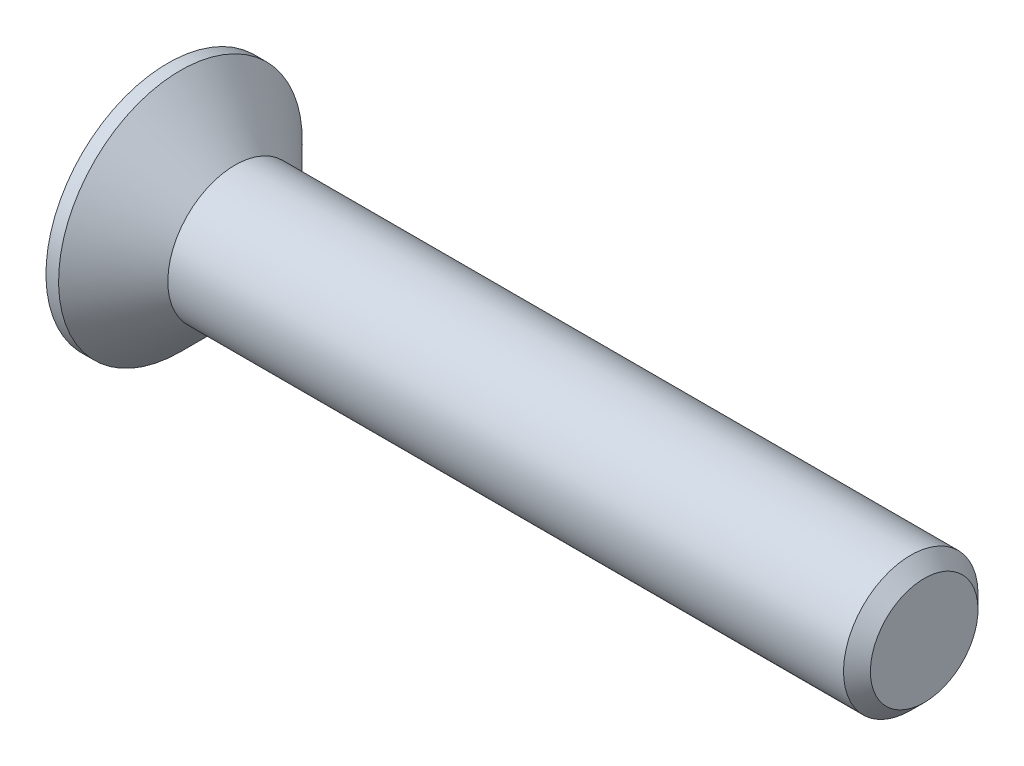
ISO-10303-21;
HEADER;
FILE_DESCRIPTION(('STEP AP214'),'2;1');
FILE_NAME('part.step','',(''),(''),'','','');
FILE_SCHEMA(('AUTOMOTIVE_DESIGN { 1 0 10303 214 1 1 1 1 }'));
ENDSEC;
DATA;
#1=APPLICATION_CONTEXT('core data for automotive mechanical design processes');
#2=APPLICATION_PROTOCOL_DEFINITION('international standard','automotive_design',2000,#1);
#3=PRODUCT_CONTEXT('',#1,'mechanical');
#4=PRODUCT('Part','Part','',(#3));
#5=PRODUCT_RELATED_PRODUCT_CATEGORY('part','',(#4));
#6=PRODUCT_DEFINITION_FORMATION('','',#4);
#7=PRODUCT_DEFINITION_CONTEXT('part definition',#1,'design');
#8=PRODUCT_DEFINITION('design','',#6,#7);
#9=PRODUCT_DEFINITION_SHAPE('','',#8);
#10=(LENGTH_UNIT() NAMED_UNIT(*) SI_UNIT(.MILLI.,.METRE.));
#11=(NAMED_UNIT(*) PLANE_ANGLE_UNIT() SI_UNIT($,.RADIAN.));
#12=(NAMED_UNIT(*) SI_UNIT($,.STERADIAN.) SOLID_ANGLE_UNIT());
#13=UNCERTAINTY_MEASURE_WITH_UNIT(LENGTH_MEASURE(1.E-05),#10,'distance_accuracy_value','');
#14=(GEOMETRIC_REPRESENTATION_CONTEXT(3) GLOBAL_UNCERTAINTY_ASSIGNED_CONTEXT((#13)) GLOBAL_UNIT_ASSIGNED_CONTEXT((#10,
#11,#12)) REPRESENTATION_CONTEXT('',''));
#15=CARTESIAN_POINT('',(0.,0.,0.));
#16=DIRECTION('',(0.,0.,1.));
#17=DIRECTION('',(1.,0.,0.));
#18=AXIS2_PLACEMENT_3D('',#15,#16,#17);
#19=CARTESIAN_POINT('',(0.,0.,0.));
#20=DIRECTION('',(-1.,0.,0.));
#21=DIRECTION('',(0.,-1.,0.));
#22=AXIS2_PLACEMENT_3D('',#19,#20,#21);
#23=CONICAL_SURFACE('',#22,4.,0.78539816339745);
#24=CARTESIAN_POINT('',(-3.24999999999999,0.,0.));
#25=DIRECTION('',(-1.,0.,0.));
#26=DIRECTION('',(0.,-1.,0.));
#27=AXIS2_PLACEMENT_3D('',#24,#25,#26);
#28=CIRCLE('',#27,7.25);
#29=CARTESIAN_POINT('',(-3.24999999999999,-7.25,0.));
#30=VERTEX_POINT('',#29);
#31=EDGE_CURVE('E189',#30,#30,#28,.T.);
#32=ORIENTED_EDGE('',*,*,#31,.F.);
#33=EDGE_LOOP('',(#32));
#34=FACE_BOUND('',#33,.T.);
#35=CARTESIAN_POINT('',(0.,0.,0.));
#36=DIRECTION('',(-1.,0.,0.));
#37=DIRECTION('',(0.,-1.,0.));
#38=AXIS2_PLACEMENT_3D('',#35,#36,#37);
#39=CIRCLE('',#38,4.);
#40=CARTESIAN_POINT('',(0.,-4.,0.));
#41=VERTEX_POINT('',#40);
#42=EDGE_CURVE('E212',#41,#41,#39,.T.);
#43=ORIENTED_EDGE('',*,*,#42,.T.);
#44=EDGE_LOOP('',(#43));
#45=FACE_BOUND('',#44,.T.);
#46=ADVANCED_FACE('F33',(#34,#45),#23,.T.);
#47=CARTESIAN_POINT('',(-4.,0.,0.));
#48=DIRECTION('',(-1.,0.,0.));
#49=DIRECTION('',(0.,-1.,0.));
#50=AXIS2_PLACEMENT_3D('',#47,#48,#49);
#51=CYLINDRICAL_SURFACE('',#50,4.);
#52=CARTESIAN_POINT('',(40.2,0.,0.));
#53=DIRECTION('',(-1.,0.,0.));
#54=DIRECTION('',(0.,-1.,0.));
#55=AXIS2_PLACEMENT_3D('',#52,#53,#54);
#56=CIRCLE('',#55,4.);
#57=CARTESIAN_POINT('',(40.2,-4.,0.));
#58=VERTEX_POINT('',#57);
#59=EDGE_CURVE('E41',#58,#58,#56,.T.);
#60=ORIENTED_EDGE('',*,*,#59,.T.);
#61=EDGE_LOOP('',(#60));
#62=FACE_BOUND('',#61,.T.);
#63=ORIENTED_EDGE('',*,*,#42,.F.);
#64=EDGE_LOOP('',(#63));
#65=FACE_BOUND('',#64,.T.);
#66=ADVANCED_FACE('F217',(#62,#65),#51,.T.);
#67=CARTESIAN_POINT('',(41.,0.,0.));
#68=DIRECTION('',(-1.,0.,0.));
#69=DIRECTION('',(0.,-1.,0.));
#70=AXIS2_PLACEMENT_3D('',#67,#68,#69);
#71=PLANE('',#70);
#72=CARTESIAN_POINT('',(41.,0.,0.));
#73=DIRECTION('',(-1.,0.,0.));
#74=DIRECTION('',(0.,-1.,0.));
#75=AXIS2_PLACEMENT_3D('',#72,#73,#74);
#76=CIRCLE('',#75,3.19999999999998);
#77=CARTESIAN_POINT('',(41.,-3.19999999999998,0.));
#78=VERTEX_POINT('',#77);
#79=EDGE_CURVE('E11',#78,#78,#76,.F.);
#80=ORIENTED_EDGE('',*,*,#79,.T.);
#81=EDGE_LOOP('',(#80));
#82=FACE_BOUND('',#81,.T.);
#83=ADVANCED_FACE('F239',(#82),#71,.F.);
#84=CARTESIAN_POINT('',(-4.,7.25,0.));
#85=DIRECTION('',(1.,0.,0.));
#86=DIRECTION('',(0.,1.,0.));
#87=AXIS2_PLACEMENT_3D('',#84,#85,#86);
#88=PLANE('',#87);
#89=DIRECTION('',(0.,0.,-1.));
#90=VECTOR('',#89,1.);
#91=CARTESIAN_POINT('',(-4.,1.09,-4.35));
#92=LINE('',#91,#90);
#93=CARTESIAN_POINT('',(-4.,1.09,-1.09));
#94=VERTEX_POINT('',#93);
#95=CARTESIAN_POINT('',(-4.,1.09,-4.35));
#96=VERTEX_POINT('',#95);
#97=EDGE_CURVE('E158',#94,#96,#92,.T.);
#98=ORIENTED_EDGE('',*,*,#97,.F.);
#99=DIRECTION('',(0.,-1.,0.));
#100=VECTOR('',#99,1.);
#101=CARTESIAN_POINT('',(-4.,1.09,-1.09));
#102=LINE('',#101,#100);
#103=CARTESIAN_POINT('',(-4.,4.35,-1.09));
#104=VERTEX_POINT('',#103);
#105=EDGE_CURVE('E48',#104,#94,#102,.T.);
#106=ORIENTED_EDGE('',*,*,#105,.F.);
#107=DIRECTION('',(0.,0.,-1.));
#108=VECTOR('',#107,1.);
#109=CARTESIAN_POINT('',(-4.,4.35,-1.09));
#110=LINE('',#109,#108);
#111=CARTESIAN_POINT('',(-4.,4.35,1.09));
#112=VERTEX_POINT('',#111);
#113=EDGE_CURVE('E185',#112,#104,#110,.T.);
#114=ORIENTED_EDGE('',*,*,#113,.F.);
#115=DIRECTION('',(0.,1.,0.));
#116=VECTOR('',#115,1.);
#117=CARTESIAN_POINT('',(-4.,4.35,1.09));
#118=LINE('',#117,#116);
#119=CARTESIAN_POINT('',(-4.,1.09,1.09));
#120=VERTEX_POINT('',#119);
#121=EDGE_CURVE('E183',#120,#112,#118,.T.);
#122=ORIENTED_EDGE('',*,*,#121,.F.);
#123=DIRECTION('',(0.,0.,-1.));
#124=VECTOR('',#123,1.);
#125=CARTESIAN_POINT('',(-4.,1.09,1.09));
#126=LINE('',#125,#124);
#127=CARTESIAN_POINT('',(-4.,1.09,4.35));
#128=VERTEX_POINT('',#127);
#129=EDGE_CURVE('E132',#128,#120,#126,.T.);
#130=ORIENTED_EDGE('',*,*,#129,.F.);
#131=DIRECTION('',(0.,1.,0.));
#132=VECTOR('',#131,1.);
#133=CARTESIAN_POINT('',(-4.,1.09,4.35));
#134=LINE('',#133,#132);
#135=CARTESIAN_POINT('',(-4.,-1.09,4.35));
#136=VERTEX_POINT('',#135);
#137=EDGE_CURVE('E179',#136,#128,#134,.T.);
#138=ORIENTED_EDGE('',*,*,#137,.F.);
#139=DIRECTION('',(0.,0.,1.));
#140=VECTOR('',#139,1.);
#141=CARTESIAN_POINT('',(-4.,-1.09,4.35));
#142=LINE('',#141,#140);
#143=CARTESIAN_POINT('',(-4.,-1.09,1.09));
#144=VERTEX_POINT('',#143);
#145=EDGE_CURVE('E176',#144,#136,#142,.T.);
#146=ORIENTED_EDGE('',*,*,#145,.F.);
#147=DIRECTION('',(0.,1.,0.));
#148=VECTOR('',#147,1.);
#149=CARTESIAN_POINT('',(-4.,-1.09,1.09));
#150=LINE('',#149,#148);
#151=CARTESIAN_POINT('',(-4.,-4.35,1.09));
#152=VERTEX_POINT('',#151);
#153=EDGE_CURVE('E173',#152,#144,#150,.T.);
#154=ORIENTED_EDGE('',*,*,#153,.F.);
#155=DIRECTION('',(0.,0.,1.));
#156=VECTOR('',#155,1.);
#157=CARTESIAN_POINT('',(-4.,-4.35,1.09));
#158=LINE('',#157,#156);
#159=CARTESIAN_POINT('',(-4.,-4.35,-1.09));
#160=VERTEX_POINT('',#159);
#161=EDGE_CURVE('E170',#160,#152,#158,.T.);
#162=ORIENTED_EDGE('',*,*,#161,.F.);
#163=DIRECTION('',(0.,-1.,0.));
#164=VECTOR('',#163,1.);
#165=CARTESIAN_POINT('',(-4.,-4.35,-1.09));
#166=LINE('',#165,#164);
#167=CARTESIAN_POINT('',(-4.,-1.09,-1.09));
#168=VERTEX_POINT('',#167);
#169=EDGE_CURVE('E167',#168,#160,#166,.T.);
#170=ORIENTED_EDGE('',*,*,#169,.F.);
#171=DIRECTION('',(0.,0.,1.));
#172=VECTOR('',#171,1.);
#173=CARTESIAN_POINT('',(-4.,-1.09,-1.09));
#174=LINE('',#173,#172);
#175=CARTESIAN_POINT('',(-4.,-1.09,-4.35));
#176=VERTEX_POINT('',#175);
#177=EDGE_CURVE('E164',#176,#168,#174,.T.);
#178=ORIENTED_EDGE('',*,*,#177,.F.);
#179=DIRECTION('',(0.,-1.,0.));
#180=VECTOR('',#179,1.);
#181=CARTESIAN_POINT('',(-4.,-1.09,-4.35));
#182=LINE('',#181,#180);
#183=EDGE_CURVE('E161',#96,#176,#182,.T.);
#184=ORIENTED_EDGE('',*,*,#183,.F.);
#185=EDGE_LOOP('',(#98,#106,#114,#122,#130,#138,#146,#154,#162,#170,#178,#184));
#186=FACE_BOUND('',#185,.T.);
#187=CARTESIAN_POINT('',(-4.,0.,0.));
#188=DIRECTION('',(-1.,0.,0.));
#189=DIRECTION('',(0.,-1.,0.));
#190=AXIS2_PLACEMENT_3D('',#187,#188,#189);
#191=CIRCLE('',#190,7.25);
#192=CARTESIAN_POINT('',(-4.,-7.25,0.));
#193=VERTEX_POINT('',#192);
#194=EDGE_CURVE('E209',#193,#193,#191,.T.);
#195=ORIENTED_EDGE('',*,*,#194,.T.);
#196=EDGE_LOOP('',(#195));
#197=FACE_BOUND('',#196,.T.);
#198=ADVANCED_FACE('F230',(#186,#197),#88,.F.);
#199=CARTESIAN_POINT('',(-4.,0.,0.));
#200=DIRECTION('',(-1.,0.,0.));
#201=DIRECTION('',(0.,-1.,0.));
#202=AXIS2_PLACEMENT_3D('',#199,#200,#201);
#203=CYLINDRICAL_SURFACE('',#202,7.25);
#204=ORIENTED_EDGE('',*,*,#194,.F.);
#205=EDGE_LOOP('',(#204));
#206=FACE_BOUND('',#205,.T.);
#207=ORIENTED_EDGE('',*,*,#31,.T.);
#208=EDGE_LOOP('',(#207));
#209=FACE_BOUND('',#208,.T.);
#210=ADVANCED_FACE('F222',(#206,#209),#203,.T.);
#211=CARTESIAN_POINT('',(40.2,0.,0.));
#212=DIRECTION('',(-1.,0.,0.));
#213=DIRECTION('',(0.,-1.,0.));
#214=AXIS2_PLACEMENT_3D('',#211,#212,#213);
#215=CONICAL_SURFACE('',#214,4.,0.785398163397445);
#216=ORIENTED_EDGE('',*,*,#79,.F.);
#217=EDGE_LOOP('',(#216));
#218=FACE_BOUND('',#217,.T.);
#219=ORIENTED_EDGE('',*,*,#59,.F.);
#220=EDGE_LOOP('',(#219));
#221=FACE_BOUND('',#220,.T.);
#222=ADVANCED_FACE('F35',(#218,#221),#215,.T.);
#223=CARTESIAN_POINT('',(-0.55,1.09,-1.09));
#224=DIRECTION('',(0.,0.,-1.));
#225=DIRECTION('',(-1.,0.,0.));
#226=AXIS2_PLACEMENT_3D('',#223,#224,#225);
#227=PLANE('',#226);
#228=ORIENTED_EDGE('',*,*,#105,.T.);
#229=DIRECTION('',(-1.,0.,0.));
#230=VECTOR('',#229,1.);
#231=CARTESIAN_POINT('',(-0.55,1.09,-1.09));
#232=LINE('',#231,#230);
#233=CARTESIAN_POINT('',(-0.55,1.09,-1.09));
#234=VERTEX_POINT('',#233);
#235=EDGE_CURVE('E96',#234,#94,#232,.T.);
#236=ORIENTED_EDGE('',*,*,#235,.F.);
#237=DIRECTION('',(0.,-1.,0.));
#238=VECTOR('',#237,1.);
#239=CARTESIAN_POINT('',(-0.55,1.09,-1.09));
#240=LINE('',#239,#238);
#241=CARTESIAN_POINT('',(-0.55,4.35,-1.09));
#242=VERTEX_POINT('',#241);
#243=EDGE_CURVE('E187',#242,#234,#240,.T.);
#244=ORIENTED_EDGE('',*,*,#243,.F.);
#245=DIRECTION('',(-1.,0.,0.));
#246=VECTOR('',#245,1.);
#247=CARTESIAN_POINT('',(-0.55,4.35,-1.09));
#248=LINE('',#247,#246);
#249=EDGE_CURVE('E56',#242,#104,#248,.T.);
#250=ORIENTED_EDGE('',*,*,#249,.T.);
#251=EDGE_LOOP('',(#228,#236,#244,#250));
#252=FACE_BOUND('',#251,.T.);
#253=ADVANCED_FACE('F221',(#252),#227,.F.);
#254=CARTESIAN_POINT('',(-0.55,4.35,-1.09));
#255=DIRECTION('',(0.,1.,0.));
#256=DIRECTION('',(-1.,0.,0.));
#257=AXIS2_PLACEMENT_3D('',#254,#255,#256);
#258=PLANE('',#257);
#259=ORIENTED_EDGE('',*,*,#113,.T.);
#260=ORIENTED_EDGE('',*,*,#249,.F.);
#261=DIRECTION('',(0.,0.,-1.));
#262=VECTOR('',#261,1.);
#263=CARTESIAN_POINT('',(-0.55,4.35,-1.09));
#264=LINE('',#263,#262);
#265=CARTESIAN_POINT('',(-0.55,4.35,1.09));
#266=VERTEX_POINT('',#265);
#267=EDGE_CURVE('E144',#266,#242,#264,.T.);
#268=ORIENTED_EDGE('',*,*,#267,.F.);
#269=DIRECTION('',(-1.,0.,0.));
#270=VECTOR('',#269,1.);
#271=CARTESIAN_POINT('',(-0.55,4.35,1.09));
#272=LINE('',#271,#270);
#273=EDGE_CURVE('E136',#266,#112,#272,.T.);
#274=ORIENTED_EDGE('',*,*,#273,.T.);
#275=EDGE_LOOP('',(#259,#260,#268,#274));
#276=FACE_BOUND('',#275,.T.);
#277=ADVANCED_FACE('F228',(#276),#258,.F.);
#278=CARTESIAN_POINT('',(-0.55,4.35,1.09));
#279=DIRECTION('',(0.,0.,1.));
#280=DIRECTION('',(1.,0.,0.));
#281=AXIS2_PLACEMENT_3D('',#278,#279,#280);
#282=PLANE('',#281);
#283=ORIENTED_EDGE('',*,*,#121,.T.);
#284=ORIENTED_EDGE('',*,*,#273,.F.);
#285=DIRECTION('',(0.,1.,0.));
#286=VECTOR('',#285,1.);
#287=CARTESIAN_POINT('',(-0.55,4.35,1.09));
#288=LINE('',#287,#286);
#289=CARTESIAN_POINT('',(-0.55,1.09,1.09));
#290=VERTEX_POINT('',#289);
#291=EDGE_CURVE('E140',#290,#266,#288,.T.);
#292=ORIENTED_EDGE('',*,*,#291,.F.);
#293=DIRECTION('',(-1.,0.,0.));
#294=VECTOR('',#293,1.);
#295=CARTESIAN_POINT('',(-0.55,1.09,1.09));
#296=LINE('',#295,#294);
#297=EDGE_CURVE('E125',#290,#120,#296,.T.);
#298=ORIENTED_EDGE('',*,*,#297,.T.);
#299=EDGE_LOOP('',(#283,#284,#292,#298));
#300=FACE_BOUND('',#299,.T.);
#301=ADVANCED_FACE('F141',(#300),#282,.F.);
#302=CARTESIAN_POINT('',(-0.55,1.09,1.09));
#303=DIRECTION('',(0.,1.,0.));
#304=DIRECTION('',(-1.,0.,0.));
#305=AXIS2_PLACEMENT_3D('',#302,#303,#304);
#306=PLANE('',#305);
#307=ORIENTED_EDGE('',*,*,#129,.T.);
#308=ORIENTED_EDGE('',*,*,#297,.F.);
#309=DIRECTION('',(0.,0.,-1.));
#310=VECTOR('',#309,1.);
#311=CARTESIAN_POINT('',(-0.55,1.09,1.09));
#312=LINE('',#311,#310);
#313=CARTESIAN_POINT('',(-0.55,1.09,4.35));
#314=VERTEX_POINT('',#313);
#315=EDGE_CURVE('E129',#314,#290,#312,.T.);
#316=ORIENTED_EDGE('',*,*,#315,.F.);
#317=DIRECTION('',(-1.,0.,0.));
#318=VECTOR('',#317,1.);
#319=CARTESIAN_POINT('',(-0.55,1.09,4.35));
#320=LINE('',#319,#318);
#321=EDGE_CURVE('E137',#314,#128,#320,.T.);
#322=ORIENTED_EDGE('',*,*,#321,.T.);
#323=EDGE_LOOP('',(#307,#308,#316,#322));
#324=FACE_BOUND('',#323,.T.);
#325=ADVANCED_FACE('F127',(#324),#306,.F.);
#326=CARTESIAN_POINT('',(-0.55,1.09,4.35));
#327=DIRECTION('',(0.,0.,1.));
#328=DIRECTION('',(1.,0.,0.));
#329=AXIS2_PLACEMENT_3D('',#326,#327,#328);
#330=PLANE('',#329);
#331=ORIENTED_EDGE('',*,*,#137,.T.);
#332=ORIENTED_EDGE('',*,*,#321,.F.);
#333=DIRECTION('',(0.,1.,0.));
#334=VECTOR('',#333,1.);
#335=CARTESIAN_POINT('',(-0.55,1.09,4.35));
#336=LINE('',#335,#334);
#337=CARTESIAN_POINT('',(-0.55,-1.09,4.35));
#338=VERTEX_POINT('',#337);
#339=EDGE_CURVE('E150',#338,#314,#336,.T.);
#340=ORIENTED_EDGE('',*,*,#339,.F.);
#341=DIRECTION('',(-1.,0.,0.));
#342=VECTOR('',#341,1.);
#343=CARTESIAN_POINT('',(-0.55,-1.09,4.35));
#344=LINE('',#343,#342);
#345=EDGE_CURVE('E192',#338,#136,#344,.T.);
#346=ORIENTED_EDGE('',*,*,#345,.T.);
#347=EDGE_LOOP('',(#331,#332,#340,#346));
#348=FACE_BOUND('',#347,.T.);
#349=ADVANCED_FACE('F277',(#348),#330,.F.);
#350=CARTESIAN_POINT('',(-0.55,-1.09,4.35));
#351=DIRECTION('',(0.,-1.,0.));
#352=DIRECTION('',(1.,0.,0.));
#353=AXIS2_PLACEMENT_3D('',#350,#351,#352);
#354=PLANE('',#353);
#355=ORIENTED_EDGE('',*,*,#145,.T.);
#356=ORIENTED_EDGE('',*,*,#345,.F.);
#357=DIRECTION('',(0.,0.,1.));
#358=VECTOR('',#357,1.);
#359=CARTESIAN_POINT('',(-0.55,-1.09,4.35));
#360=LINE('',#359,#358);
#361=CARTESIAN_POINT('',(-0.55,-1.09,1.09));
#362=VERTEX_POINT('',#361);
#363=EDGE_CURVE('E152',#362,#338,#360,.T.);
#364=ORIENTED_EDGE('',*,*,#363,.F.);
#365=DIRECTION('',(-1.,0.,0.));
#366=VECTOR('',#365,1.);
#367=CARTESIAN_POINT('',(-0.55,-1.09,1.09));
#368=LINE('',#367,#366);
#369=EDGE_CURVE('E194',#362,#144,#368,.T.);
#370=ORIENTED_EDGE('',*,*,#369,.T.);
#371=EDGE_LOOP('',(#355,#356,#364,#370));
#372=FACE_BOUND('',#371,.T.);
#373=ADVANCED_FACE('F273',(#372),#354,.F.);
#374=CARTESIAN_POINT('',(-0.55,-1.09,1.09));
#375=DIRECTION('',(0.,0.,1.));
#376=DIRECTION('',(1.,0.,0.));
#377=AXIS2_PLACEMENT_3D('',#374,#375,#376);
#378=PLANE('',#377);
#379=ORIENTED_EDGE('',*,*,#153,.T.);
#380=ORIENTED_EDGE('',*,*,#369,.F.);
#381=DIRECTION('',(0.,1.,0.));
#382=VECTOR('',#381,1.);
#383=CARTESIAN_POINT('',(-0.55,-1.09,1.09));
#384=LINE('',#383,#382);
#385=CARTESIAN_POINT('',(-0.55,-4.35,1.09));
#386=VERTEX_POINT('',#385);
#387=EDGE_CURVE('E422',#386,#362,#384,.T.);
#388=ORIENTED_EDGE('',*,*,#387,.F.);
#389=DIRECTION('',(-1.,0.,0.));
#390=VECTOR('',#389,1.);
#391=CARTESIAN_POINT('',(-0.55,-4.35,1.09));
#392=LINE('',#391,#390);
#393=EDGE_CURVE('E196',#386,#152,#392,.T.);
#394=ORIENTED_EDGE('',*,*,#393,.T.);
#395=EDGE_LOOP('',(#379,#380,#388,#394));
#396=FACE_BOUND('',#395,.T.);
#397=ADVANCED_FACE('F269',(#396),#378,.F.);
#398=CARTESIAN_POINT('',(-0.55,-4.35,1.09));
#399=DIRECTION('',(0.,-1.,0.));
#400=DIRECTION('',(1.,0.,0.));
#401=AXIS2_PLACEMENT_3D('',#398,#399,#400);
#402=PLANE('',#401);
#403=ORIENTED_EDGE('',*,*,#161,.T.);
#404=ORIENTED_EDGE('',*,*,#393,.F.);
#405=DIRECTION('',(0.,0.,1.));
#406=VECTOR('',#405,1.);
#407=CARTESIAN_POINT('',(-0.55,-4.35,1.09));
#408=LINE('',#407,#406);
#409=CARTESIAN_POINT('',(-0.55,-4.35,-1.09));
#410=VERTEX_POINT('',#409);
#411=EDGE_CURVE('E419',#410,#386,#408,.T.);
#412=ORIENTED_EDGE('',*,*,#411,.F.);
#413=DIRECTION('',(-1.,0.,0.));
#414=VECTOR('',#413,1.);
#415=CARTESIAN_POINT('',(-0.55,-4.35,-1.09));
#416=LINE('',#415,#414);
#417=EDGE_CURVE('E198',#410,#160,#416,.T.);
#418=ORIENTED_EDGE('',*,*,#417,.T.);
#419=EDGE_LOOP('',(#403,#404,#412,#418));
#420=FACE_BOUND('',#419,.T.);
#421=ADVANCED_FACE('F265',(#420),#402,.F.);
#422=CARTESIAN_POINT('',(-0.55,-4.35,-1.09));
#423=DIRECTION('',(0.,0.,-1.));
#424=DIRECTION('',(-1.,0.,0.));
#425=AXIS2_PLACEMENT_3D('',#422,#423,#424);
#426=PLANE('',#425);
#427=ORIENTED_EDGE('',*,*,#169,.T.);
#428=ORIENTED_EDGE('',*,*,#417,.F.);
#429=DIRECTION('',(0.,-1.,0.));
#430=VECTOR('',#429,1.);
#431=CARTESIAN_POINT('',(-0.55,-4.35,-1.09));
#432=LINE('',#431,#430);
#433=CARTESIAN_POINT('',(-0.55,-1.09,-1.09));
#434=VERTEX_POINT('',#433);
#435=EDGE_CURVE('E416',#434,#410,#432,.T.);
#436=ORIENTED_EDGE('',*,*,#435,.F.);
#437=DIRECTION('',(-1.,0.,0.));
#438=VECTOR('',#437,1.);
#439=CARTESIAN_POINT('',(-0.55,-1.09,-1.09));
#440=LINE('',#439,#438);
#441=EDGE_CURVE('E200',#434,#168,#440,.T.);
#442=ORIENTED_EDGE('',*,*,#441,.T.);
#443=EDGE_LOOP('',(#427,#428,#436,#442));
#444=FACE_BOUND('',#443,.T.);
#445=ADVANCED_FACE('F261',(#444),#426,.F.);
#446=CARTESIAN_POINT('',(-0.55,-1.09,-1.09));
#447=DIRECTION('',(0.,-1.,0.));
#448=DIRECTION('',(1.,0.,0.));
#449=AXIS2_PLACEMENT_3D('',#446,#447,#448);
#450=PLANE('',#449);
#451=ORIENTED_EDGE('',*,*,#177,.T.);
#452=ORIENTED_EDGE('',*,*,#441,.F.);
#453=DIRECTION('',(0.,0.,1.));
#454=VECTOR('',#453,1.);
#455=CARTESIAN_POINT('',(-0.55,-1.09,-1.09));
#456=LINE('',#455,#454);
#457=CARTESIAN_POINT('',(-0.55,-1.09,-4.35));
#458=VERTEX_POINT('',#457);
#459=EDGE_CURVE('E413',#458,#434,#456,.T.);
#460=ORIENTED_EDGE('',*,*,#459,.F.);
#461=DIRECTION('',(-1.,0.,0.));
#462=VECTOR('',#461,1.);
#463=CARTESIAN_POINT('',(-0.55,-1.09,-4.35));
#464=LINE('',#463,#462);
#465=EDGE_CURVE('E202',#458,#176,#464,.T.);
#466=ORIENTED_EDGE('',*,*,#465,.T.);
#467=EDGE_LOOP('',(#451,#452,#460,#466));
#468=FACE_BOUND('',#467,.T.);
#469=ADVANCED_FACE('F257',(#468),#450,.F.);
#470=CARTESIAN_POINT('',(-0.55,-1.09,-4.35));
#471=DIRECTION('',(0.,0.,-1.));
#472=DIRECTION('',(-1.,0.,0.));
#473=AXIS2_PLACEMENT_3D('',#470,#471,#472);
#474=PLANE('',#473);
#475=ORIENTED_EDGE('',*,*,#183,.T.);
#476=ORIENTED_EDGE('',*,*,#465,.F.);
#477=DIRECTION('',(0.,-1.,0.));
#478=VECTOR('',#477,1.);
#479=CARTESIAN_POINT('',(-0.55,-1.09,-4.35));
#480=LINE('',#479,#478);
#481=CARTESIAN_POINT('',(-0.55,1.09,-4.35));
#482=VERTEX_POINT('',#481);
#483=EDGE_CURVE('E408',#482,#458,#480,.T.);
#484=ORIENTED_EDGE('',*,*,#483,.F.);
#485=DIRECTION('',(-1.,0.,0.));
#486=VECTOR('',#485,1.);
#487=CARTESIAN_POINT('',(-0.55,1.09,-4.35));
#488=LINE('',#487,#486);
#489=EDGE_CURVE('E204',#482,#96,#488,.T.);
#490=ORIENTED_EDGE('',*,*,#489,.T.);
#491=EDGE_LOOP('',(#475,#476,#484,#490));
#492=FACE_BOUND('',#491,.T.);
#493=ADVANCED_FACE('F253',(#492),#474,.F.);
#494=CARTESIAN_POINT('',(-0.55,1.09,-4.35));
#495=DIRECTION('',(0.,1.,0.));
#496=DIRECTION('',(-1.,0.,0.));
#497=AXIS2_PLACEMENT_3D('',#494,#495,#496);
#498=PLANE('',#497);
#499=ORIENTED_EDGE('',*,*,#97,.T.);
#500=ORIENTED_EDGE('',*,*,#489,.F.);
#501=DIRECTION('',(0.,0.,-1.));
#502=VECTOR('',#501,1.);
#503=CARTESIAN_POINT('',(-0.55,1.09,-4.35));
#504=LINE('',#503,#502);
#505=EDGE_CURVE('E406',#234,#482,#504,.T.);
#506=ORIENTED_EDGE('',*,*,#505,.F.);
#507=ORIENTED_EDGE('',*,*,#235,.T.);
#508=EDGE_LOOP('',(#499,#500,#506,#507));
#509=FACE_BOUND('',#508,.T.);
#510=ADVANCED_FACE('F250',(#509),#498,.F.);
#511=CARTESIAN_POINT('',(-0.55,0.,0.));
#512=DIRECTION('',(1.,0.,0.));
#513=DIRECTION('',(0.,0.,-1.));
#514=AXIS2_PLACEMENT_3D('',#511,#512,#513);
#515=PLANE('',#514);
#516=ORIENTED_EDGE('',*,*,#243,.T.);
#517=ORIENTED_EDGE('',*,*,#505,.T.);
#518=ORIENTED_EDGE('',*,*,#483,.T.);
#519=ORIENTED_EDGE('',*,*,#459,.T.);
#520=ORIENTED_EDGE('',*,*,#435,.T.);
#521=ORIENTED_EDGE('',*,*,#411,.T.);
#522=ORIENTED_EDGE('',*,*,#387,.T.);
#523=ORIENTED_EDGE('',*,*,#363,.T.);
#524=ORIENTED_EDGE('',*,*,#339,.T.);
#525=ORIENTED_EDGE('',*,*,#315,.T.);
#526=ORIENTED_EDGE('',*,*,#291,.T.);
#527=ORIENTED_EDGE('',*,*,#267,.T.);
#528=EDGE_LOOP('',(#516,#517,#518,#519,#520,#521,#522,#523,#524,#525,#526,#527));
#529=FACE_BOUND('',#528,.T.);
#530=ADVANCED_FACE('F147',(#529),#515,.F.);
#531=CLOSED_SHELL('',(#46,#66,#83,#198,#210,#222,#253,#277,#301,#325,#349,#373,#397,#421,#445,
#469,#493,#510,#530));
#532=MANIFOLD_SOLID_BREP('B2',#531);
#533=ADVANCED_BREP_SHAPE_REPRESENTATION('',(#18,#532),#14);
#534=SHAPE_DEFINITION_REPRESENTATION(#9,#533);
ENDSEC;
END-ISO-10303-21;
